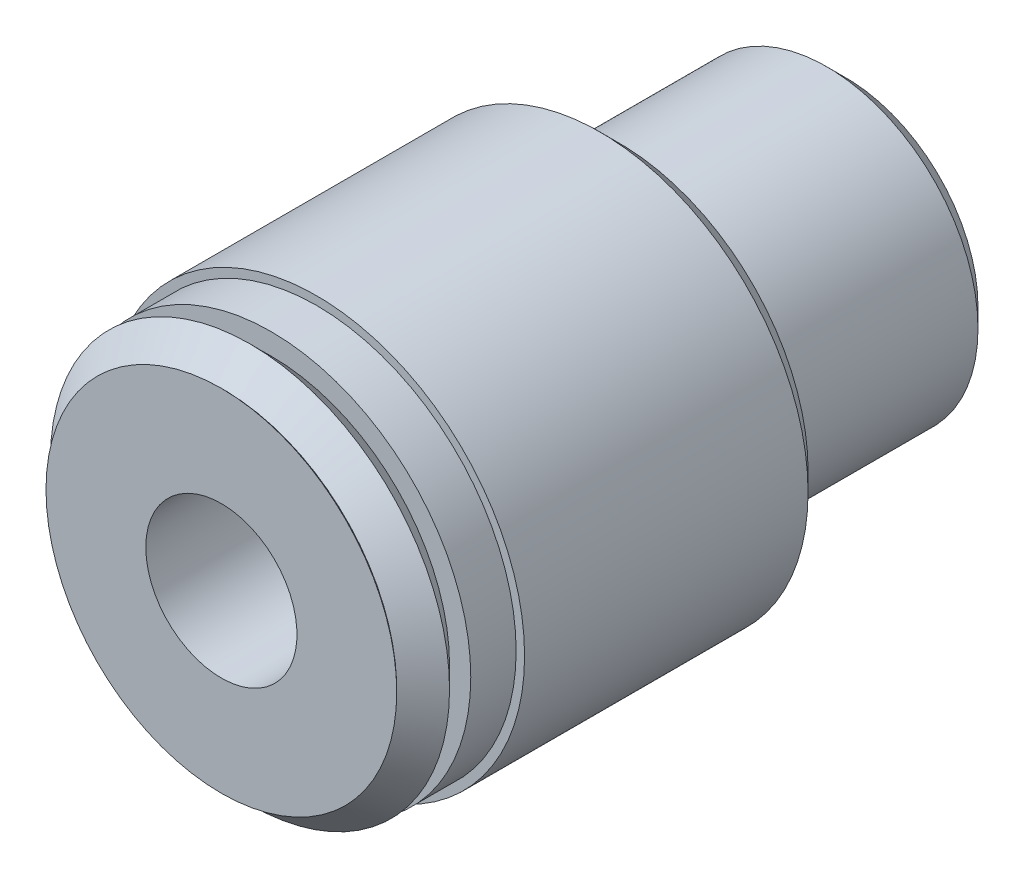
ISO-10303-21;
HEADER;
FILE_DESCRIPTION(('STEP AP214'),'2;1');
FILE_NAME('part.step','',(''),(''),'','','');
FILE_SCHEMA(('AUTOMOTIVE_DESIGN { 1 0 10303 214 1 1 1 1 }'));
ENDSEC;
DATA;
#1=APPLICATION_CONTEXT('core data for automotive mechanical design processes');
#2=APPLICATION_PROTOCOL_DEFINITION('international standard','automotive_design',2000,#1);
#3=PRODUCT_CONTEXT('',#1,'mechanical');
#4=PRODUCT('Part','Part','',(#3));
#5=PRODUCT_RELATED_PRODUCT_CATEGORY('part','',(#4));
#6=PRODUCT_DEFINITION_FORMATION('','',#4);
#7=PRODUCT_DEFINITION_CONTEXT('part definition',#1,'design');
#8=PRODUCT_DEFINITION('design','',#6,#7);
#9=PRODUCT_DEFINITION_SHAPE('','',#8);
#10=(LENGTH_UNIT() NAMED_UNIT(*) SI_UNIT(.MILLI.,.METRE.));
#11=(NAMED_UNIT(*) PLANE_ANGLE_UNIT() SI_UNIT($,.RADIAN.));
#12=(NAMED_UNIT(*) SI_UNIT($,.STERADIAN.) SOLID_ANGLE_UNIT());
#13=UNCERTAINTY_MEASURE_WITH_UNIT(LENGTH_MEASURE(1.E-05),#10,'distance_accuracy_value','');
#14=(GEOMETRIC_REPRESENTATION_CONTEXT(3) GLOBAL_UNCERTAINTY_ASSIGNED_CONTEXT((#13)) GLOBAL_UNIT_ASSIGNED_CONTEXT((#10,
#11,#12)) REPRESENTATION_CONTEXT('',''));
#15=CARTESIAN_POINT('',(0.,0.,0.));
#16=DIRECTION('',(0.,0.,1.));
#17=DIRECTION('',(1.,0.,0.));
#18=AXIS2_PLACEMENT_3D('',#15,#16,#17);
#19=CARTESIAN_POINT('',(0.,0.,0.));
#20=DIRECTION('',(0.,0.,1.));
#21=DIRECTION('',(1.,0.,0.));
#22=AXIS2_PLACEMENT_3D('',#19,#20,#21);
#23=PLANE('',#22);
#24=CARTESIAN_POINT('',(0.,0.,0.));
#25=DIRECTION('',(0.,0.,-1.));
#26=DIRECTION('',(-1.,0.,0.));
#27=AXIS2_PLACEMENT_3D('',#24,#25,#26);
#28=CIRCLE('',#27,7.366);
#29=CARTESIAN_POINT('',(-7.366,0.,0.));
#30=VERTEX_POINT('',#29);
#31=EDGE_CURVE('E115',#30,#30,#28,.T.);
#32=ORIENTED_EDGE('',*,*,#31,.F.);
#33=EDGE_LOOP('',(#32));
#34=FACE_BOUND('',#33,.T.);
#35=CARTESIAN_POINT('',(0.,0.,0.));
#36=DIRECTION('',(0.,0.,-1.));
#37=DIRECTION('',(-1.,0.,0.));
#38=AXIS2_PLACEMENT_3D('',#35,#36,#37);
#39=CIRCLE('',#38,3.175);
#40=CARTESIAN_POINT('',(-3.175,0.,0.));
#41=VERTEX_POINT('',#40);
#42=EDGE_CURVE('E126',#41,#41,#39,.T.);
#43=ORIENTED_EDGE('',*,*,#42,.T.);
#44=EDGE_LOOP('',(#43));
#45=FACE_BOUND('',#44,.T.);
#46=ADVANCED_FACE('F30',(#34,#45),#23,.T.);
#47=CARTESIAN_POINT('',(0.,0.,-26.223214));
#48=DIRECTION('',(0.,0.,-1.));
#49=DIRECTION('',(-1.,0.,0.));
#50=AXIS2_PLACEMENT_3D('',#47,#48,#49);
#51=PLANE('',#50);
#52=CARTESIAN_POINT('',(0.,0.,-26.223214));
#53=DIRECTION('',(0.,0.,-1.));
#54=DIRECTION('',(-1.,0.,0.));
#55=AXIS2_PLACEMENT_3D('',#52,#53,#54);
#56=CIRCLE('',#55,5.55625);
#57=CARTESIAN_POINT('',(5.55625,0.,-26.223214));
#58=VERTEX_POINT('',#57);
#59=EDGE_CURVE('E47',#58,#58,#56,.T.);
#60=ORIENTED_EDGE('',*,*,#59,.T.);
#61=EDGE_LOOP('',(#60));
#62=FACE_BOUND('',#61,.T.);
#63=CARTESIAN_POINT('',(0.,0.,-26.223214));
#64=DIRECTION('',(0.,0.,-1.));
#65=DIRECTION('',(-1.,0.,0.));
#66=AXIS2_PLACEMENT_3D('',#63,#64,#65);
#67=CIRCLE('',#66,3.175);
#68=CARTESIAN_POINT('',(-3.175,0.,-26.223214));
#69=VERTEX_POINT('',#68);
#70=EDGE_CURVE('E124',#69,#69,#67,.T.);
#71=ORIENTED_EDGE('',*,*,#70,.F.);
#72=EDGE_LOOP('',(#71));
#73=FACE_BOUND('',#72,.T.);
#74=ADVANCED_FACE('F63',(#62,#73),#51,.T.);
#75=CARTESIAN_POINT('',(-8.7376,0.,-7.173214));
#76=DIRECTION('',(1.,0.,0.));
#77=DIRECTION('',(0.,0.,-1.));
#78=AXIS2_PLACEMENT_3D('',#75,#76,#77);
#79=CYLINDRICAL_SURFACE('',#78,2.032);
#80=CARTESIAN_POINT('',(-8.7376,0.,-9.205214));
#81=CARTESIAN_POINT('',(-8.73759797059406,-0.11251614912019,-9.20521042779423));
#82=CARTESIAN_POINT('',(-8.7354047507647,-0.225074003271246,-9.1958371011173));
#83=CARTESIAN_POINT('',(-8.72686767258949,-0.446980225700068,-9.15863769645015));
#84=CARTESIAN_POINT('',(-8.72052111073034,-0.556326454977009,-9.13079959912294));
#85=CARTESIAN_POINT('',(-8.70438234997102,-0.768571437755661,-9.05759945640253));
#86=CARTESIAN_POINT('',(-8.6945939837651,-0.871477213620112,-9.0122568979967));
#87=CARTESIAN_POINT('',(-8.67262205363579,-1.06821919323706,-8.90539972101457));
#88=CARTESIAN_POINT('',(-8.66043848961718,-1.16205539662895,-8.84388510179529));
#89=CARTESIAN_POINT('',(-8.63476052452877,-1.33968569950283,-8.7052590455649));
#90=CARTESIAN_POINT('',(-8.62124813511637,-1.42329320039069,-8.62791182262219));
#91=CARTESIAN_POINT('',(-8.59455904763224,-1.57647313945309,-8.46032176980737));
#92=CARTESIAN_POINT('',(-8.58138238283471,-1.64604419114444,-8.37007766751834));
#93=CARTESIAN_POINT('',(-8.55667768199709,-1.7700227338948,-8.17784635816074));
#94=CARTESIAN_POINT('',(-8.54517260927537,-1.82422727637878,-8.07572504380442));
#95=CARTESIAN_POINT('',(-8.52537378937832,-1.91463093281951,-7.86351031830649));
#96=CARTESIAN_POINT('',(-8.51707960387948,-1.9508325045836,-7.75341799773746));
#97=CARTESIAN_POINT('',(-8.50482562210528,-2.00357737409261,-7.53042272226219));
#98=CARTESIAN_POINT('',(-8.50079258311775,-2.02045329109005,-7.4176025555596));
#99=CARTESIAN_POINT('',(-8.4972978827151,-2.03510284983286,-7.19066583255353));
#100=CARTESIAN_POINT('',(-8.49783558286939,-2.03287915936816,-7.07654945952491));
#101=CARTESIAN_POINT('',(-8.50335549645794,-2.00965931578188,-6.85276454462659));
#102=CARTESIAN_POINT('',(-8.50824523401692,-1.9890537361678,-6.74305284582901));
#103=CARTESIAN_POINT('',(-8.52177157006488,-1.93027563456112,-6.52868762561));
#104=CARTESIAN_POINT('',(-8.53040840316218,-1.89210201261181,-6.42403442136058));
#105=CARTESIAN_POINT('',(-8.55054421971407,-1.79892392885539,-6.22168063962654));
#106=CARTESIAN_POINT('',(-8.56206795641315,-1.7437729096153,-6.12405011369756));
#107=CARTESIAN_POINT('',(-8.5866644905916,-1.61830836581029,-5.93928667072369));
#108=CARTESIAN_POINT('',(-8.59973752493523,-1.54799252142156,-5.85215536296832));
#109=CARTESIAN_POINT('',(-8.62635329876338,-1.39214573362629,-5.68861933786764));
#110=CARTESIAN_POINT('',(-8.63989969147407,-1.30628371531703,-5.61253037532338));
#111=CARTESIAN_POINT('',(-8.66564488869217,-1.12286054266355,-5.47577636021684));
#112=CARTESIAN_POINT('',(-8.67784366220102,-1.02529911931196,-5.41511166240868));
#113=CARTESIAN_POINT('',(-8.69956723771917,-0.820833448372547,-5.3108342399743));
#114=CARTESIAN_POINT('',(-8.70908487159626,-0.713905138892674,-5.26726710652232));
#115=CARTESIAN_POINT('',(-8.72432110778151,-0.493973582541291,-5.19880975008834));
#116=CARTESIAN_POINT('',(-8.73004033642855,-0.380971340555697,-5.17391644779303));
#117=CARTESIAN_POINT('',(-8.73694469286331,-0.15480428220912,-5.14398241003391));
#118=CARTESIAN_POINT('',(-8.73822817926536,-0.0416993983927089,-5.13851093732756));
#119=CARTESIAN_POINT('',(-8.73639399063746,0.183808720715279,-5.14640245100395));
#120=CARTESIAN_POINT('',(-8.73327665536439,0.296212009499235,-5.15976398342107));
#121=CARTESIAN_POINT('',(-8.72305358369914,0.515669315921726,-5.20458583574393));
#122=CARTESIAN_POINT('',(-8.71599851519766,0.622772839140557,-5.23581635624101));
#123=CARTESIAN_POINT('',(-8.69869154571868,0.830218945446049,-5.31523144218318));
#124=CARTESIAN_POINT('',(-8.68843934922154,0.930560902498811,-5.36341757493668));
#125=CARTESIAN_POINT('',(-8.66563542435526,1.123388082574,-5.47624658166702));
#126=CARTESIAN_POINT('',(-8.65304991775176,1.21572409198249,-5.54113748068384));
#127=CARTESIAN_POINT('',(-8.62703722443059,1.3883502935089,-5.68521157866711));
#128=CARTESIAN_POINT('',(-8.61360991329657,1.46863869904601,-5.76439689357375));
#129=CARTESIAN_POINT('',(-8.58708097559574,1.61662481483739,-5.93679944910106));
#130=CARTESIAN_POINT('',(-8.57399212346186,1.68402246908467,-6.03027660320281));
#131=CARTESIAN_POINT('',(-8.54994125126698,1.8021675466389,-6.22747354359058));
#132=CARTESIAN_POINT('',(-8.53897913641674,1.85291571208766,-6.33119287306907));
#133=CARTESIAN_POINT('',(-8.52053551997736,1.93595940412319,-6.54536375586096));
#134=CARTESIAN_POINT('',(-8.51303376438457,1.96836256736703,-6.6557717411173));
#135=CARTESIAN_POINT('',(-8.5023300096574,2.01410032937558,-6.88066534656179));
#136=CARTESIAN_POINT('',(-8.49912721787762,2.02743844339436,-6.99515021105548));
#137=CARTESIAN_POINT('',(-8.49743852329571,2.03450298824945,-7.22191105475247));
#138=CARTESIAN_POINT('',(-8.49883782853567,2.02870668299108,-7.33417156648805));
#139=CARTESIAN_POINT('',(-8.50593357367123,1.99874469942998,-7.55606831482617));
#140=CARTESIAN_POINT('',(-8.51162994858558,1.97457929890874,-7.66570459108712));
#141=CARTESIAN_POINT('',(-8.52661852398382,1.90880893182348,-7.87880189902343));
#142=CARTESIAN_POINT('',(-8.53589461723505,1.86728201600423,-7.98228822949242));
#143=CARTESIAN_POINT('',(-8.55700187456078,1.76803152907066,-8.18089276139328));
#144=CARTESIAN_POINT('',(-8.56883334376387,1.71030602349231,-8.27600996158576));
#145=CARTESIAN_POINT('',(-8.59405451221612,1.5787511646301,-8.45750939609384));
#146=CARTESIAN_POINT('',(-8.60747352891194,1.50458544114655,-8.54364379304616));
#147=CARTESIAN_POINT('',(-8.63417061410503,1.3429261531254,-8.70240034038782));
#148=CARTESIAN_POINT('',(-8.64744864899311,1.2554294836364,-8.77501933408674));
#149=CARTESIAN_POINT('',(-8.67260607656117,1.06799924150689,-8.90574186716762));
#150=CARTESIAN_POINT('',(-8.68446134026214,0.967897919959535,-8.96360983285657));
#151=CARTESIAN_POINT('',(-8.70519060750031,0.759128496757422,-9.06160543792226));
#152=CARTESIAN_POINT('',(-8.71406695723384,0.65046722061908,-9.1017470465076));
#153=CARTESIAN_POINT('',(-8.72636889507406,0.451515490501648,-9.15650029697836));
#154=CARTESIAN_POINT('',(-8.73055328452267,0.362250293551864,-9.17473116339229));
#155=CARTESIAN_POINT('',(-8.73616958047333,0.18199909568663,-9.19908911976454));
#156=CARTESIAN_POINT('',(-8.73760164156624,0.0910131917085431,-9.20521688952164));
#157=CARTESIAN_POINT('',(-8.7376,0.,-9.205214));
#158=B_SPLINE_CURVE_WITH_KNOTS('',3,(#80,#81,#82,#83,#84,#85,#86,#87,#88,#89,#90,#91,#92,#93,
#94,#95,#96,#97,#98,#99,#100,#101,#102,#103,#104,#105,#106,#107,#108,#109,#110,#111,#112,#113,
#114,#115,#116,#117,#118,#119,#120,#121,#122,#123,#124,#125,#126,#127,#128,#129,#130,#131,#132,
#133,#134,#135,#136,#137,#138,#139,#140,#141,#142,#143,#144,#145,#146,#147,#148,#149,#150,#151,
#152,#153,#154,#155,#156,#157),.UNSPECIFIED.,.T.,.F.,(4,2,2,2,2,2,2,2,2,2,2,2,2,2,2,2,2,2,2,2,2,
2,2,2,2,2,2,2,2,2,2,2,2,2,2,2,2,2,4),(0.,0.337215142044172,0.674650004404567,1.01171029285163,
1.34877059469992,1.69127297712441,2.0338091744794,2.38067838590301,2.72750022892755,
3.06825860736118,3.40896939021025,3.74260884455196,4.07626919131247,4.41289470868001,
4.74957175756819,5.0945120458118,5.4394602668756,5.78532215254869,6.13112699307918,
6.46921292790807,6.807272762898,7.14107976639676,7.47491763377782,7.81403098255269,
8.15319457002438,8.49948578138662,8.8457615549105,9.18998397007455,9.53414290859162,
9.86978309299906,10.2054182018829,10.5395603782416,10.8737424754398,11.2155243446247,
11.5573859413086,11.9044062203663,12.2511525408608,12.5239378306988,12.7967077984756),.UNSPECIFIED.);
#159=CARTESIAN_POINT('',(-8.7376,0.,-9.205214));
#160=VERTEX_POINT('',#159);
#161=EDGE_CURVE('E10',#160,#160,#158,.T.);
#162=ORIENTED_EDGE('',*,*,#161,.T.);
#163=EDGE_LOOP('',(#162));
#164=FACE_BOUND('',#163,.T.);
#165=CARTESIAN_POINT('',(-3.175,0.,-9.205214));
#166=CARTESIAN_POINT('',(-3.17499204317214,-0.102802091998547,-9.20520536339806));
#167=CARTESIAN_POINT('',(-3.16995556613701,-0.205712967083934,-9.19735978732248));
#168=CARTESIAN_POINT('',(-3.15028428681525,-0.408345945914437,-9.16640909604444));
#169=CARTESIAN_POINT('',(-3.13563350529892,-0.508062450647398,-9.14327857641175));
#170=CARTESIAN_POINT('',(-3.09820061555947,-0.700991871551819,-9.08313445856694));
#171=CARTESIAN_POINT('',(-3.07545897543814,-0.794234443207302,-9.04618990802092));
#172=CARTESIAN_POINT('',(-3.02371392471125,-0.972850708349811,-8.95995202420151));
#173=CARTESIAN_POINT('',(-2.99471088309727,-1.0582248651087,-8.91065941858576));
#174=CARTESIAN_POINT('',(-2.93000295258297,-1.22657617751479,-8.79669771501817));
#175=CARTESIAN_POINT('',(-2.89394397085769,-1.30878643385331,-8.7311008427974));
#176=CARTESIAN_POINT('',(-2.81976531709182,-1.46177780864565,-8.58855264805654));
#177=CARTESIAN_POINT('',(-2.7816428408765,-1.53254282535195,-8.51158561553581));
#178=CARTESIAN_POINT('',(-2.70106343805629,-1.6709775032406,-8.33559847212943));
#179=CARTESIAN_POINT('',(-2.65876858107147,-1.73674918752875,-8.23499866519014));
#180=CARTESIAN_POINT('',(-2.58104184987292,-1.8502950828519,-8.02171977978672));
#181=CARTESIAN_POINT('',(-2.5455982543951,-1.89810016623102,-7.90906185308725));
#182=CARTESIAN_POINT('',(-2.49563815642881,-1.96306433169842,-7.70567829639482));
#183=CARTESIAN_POINT('',(-2.47805527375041,-1.9850125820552,-7.61724160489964));
#184=CARTESIAN_POINT('',(-2.45219187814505,-2.01688234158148,-7.4369526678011));
#185=CARTESIAN_POINT('',(-2.4438972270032,-2.02682213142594,-7.34510583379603));
#186=CARTESIAN_POINT('',(-2.43787169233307,-2.03406844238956,-7.16026810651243));
#187=CARTESIAN_POINT('',(-2.44017346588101,-2.03133590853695,-7.06727455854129));
#188=CARTESIAN_POINT('',(-2.45503753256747,-2.01334074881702,-6.8833166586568));
#189=CARTESIAN_POINT('',(-2.46760829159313,-1.99806778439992,-6.79235404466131));
#190=CARTESIAN_POINT('',(-2.50064563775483,-1.95654400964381,-6.61751211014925));
#191=CARTESIAN_POINT('',(-2.52086589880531,-1.9306337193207,-6.53350251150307));
#192=CARTESIAN_POINT('',(-2.56695150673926,-1.86892073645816,-6.37088459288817));
#193=CARTESIAN_POINT('',(-2.59281872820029,-1.83311475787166,-6.29227807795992));
#194=CARTESIAN_POINT('',(-2.65331736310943,-1.74468379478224,-6.12652736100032));
#195=CARTESIAN_POINT('',(-2.68867632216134,-1.69014547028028,-6.04067077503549));
#196=CARTESIAN_POINT('',(-2.76097453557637,-1.56927250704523,-5.87835316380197));
#197=CARTESIAN_POINT('',(-2.79791562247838,-1.50292389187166,-5.80190345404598));
#198=CARTESIAN_POINT('',(-2.87709972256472,-1.34609593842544,-5.64633172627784));
#199=CARTESIAN_POINT('',(-2.91908129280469,-1.25342255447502,-5.56926417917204));
#200=CARTESIAN_POINT('',(-2.99680453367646,-1.05412916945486,-5.43182360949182));
#201=CARTESIAN_POINT('',(-3.03255285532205,-0.94752424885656,-5.37143275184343));
#202=CARTESIAN_POINT('',(-3.08776548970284,-0.745027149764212,-5.28013920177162));
#203=CARTESIAN_POINT('',(-3.1090528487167,-0.651197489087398,-5.24576465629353));
#204=CARTESIAN_POINT('',(-3.14330309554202,-0.458101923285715,-5.19098933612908));
#205=CARTESIAN_POINT('',(-3.15627267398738,-0.358840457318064,-5.17057732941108));
#206=CARTESIAN_POINT('',(-3.17272053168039,-0.157245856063,-5.14475268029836));
#207=CARTESIAN_POINT('',(-3.1761669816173,-0.054903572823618,-5.13939033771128));
#208=CARTESIAN_POINT('',(-3.17313166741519,0.149278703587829,-5.14413361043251));
#209=CARTESIAN_POINT('',(-3.16664932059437,0.251118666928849,-5.15424013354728));
#210=CARTESIAN_POINT('',(-3.14499563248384,0.445777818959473,-5.18838229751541));
#211=CARTESIAN_POINT('',(-3.13030442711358,0.538788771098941,-5.21164904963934));
#212=CARTESIAN_POINT('',(-3.09380938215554,0.719347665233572,-5.27043053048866));
#213=CARTESIAN_POINT('',(-3.07200434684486,0.80689468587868,-5.3059473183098));
#214=CARTESIAN_POINT('',(-3.02103940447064,0.981221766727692,-5.39098970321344));
#215=CARTESIAN_POINT('',(-2.99145375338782,1.06746270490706,-5.44135934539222));
#216=CARTESIAN_POINT('',(-2.92809272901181,1.23068208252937,-5.55325920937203));
#217=CARTESIAN_POINT('',(-2.89431411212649,1.3076532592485,-5.6147980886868));
#218=CARTESIAN_POINT('',(-2.81960831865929,1.46249777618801,-5.75798156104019));
#219=CARTESIAN_POINT('',(-2.77837700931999,1.53871535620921,-5.84126130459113));
#220=CARTESIAN_POINT('',(-2.69736409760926,1.67667876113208,-6.01974184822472));
#221=CARTESIAN_POINT('',(-2.65758278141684,1.73842174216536,-6.11494498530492));
#222=CARTESIAN_POINT('',(-2.58908117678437,1.83860127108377,-6.30242967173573));
#223=CARTESIAN_POINT('',(-2.55959229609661,1.87906802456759,-6.3933387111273));
#224=CARTESIAN_POINT('',(-2.50855535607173,1.94668410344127,-6.58206167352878));
#225=CARTESIAN_POINT('',(-2.48699628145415,1.9738519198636,-6.67986579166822));
#226=CARTESIAN_POINT('',(-2.45497691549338,2.01355343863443,-6.88126291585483));
#227=CARTESIAN_POINT('',(-2.44462296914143,2.02594703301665,-6.98490173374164));
#228=CARTESIAN_POINT('',(-2.43745721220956,2.03456932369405,-7.19329147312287));
#229=CARTESIAN_POINT('',(-2.44063557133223,2.0308097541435,-7.29804153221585));
#230=CARTESIAN_POINT('',(-2.45842888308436,2.00920052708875,-7.48955089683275));
#231=CARTESIAN_POINT('',(-2.47133063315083,1.99345832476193,-7.57672835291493));
#232=CARTESIAN_POINT('',(-2.50475552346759,1.95129345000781,-7.74695573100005));
#233=CARTESIAN_POINT('',(-2.52528621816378,1.92486018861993,-7.83000146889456));
#234=CARTESIAN_POINT('',(-2.5797835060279,1.85150505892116,-8.01844149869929));
#235=CARTESIAN_POINT('',(-2.61594204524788,1.80066154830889,-8.12167247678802));
#236=CARTESIAN_POINT('',(-2.69289797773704,1.68340470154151,-8.31697407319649));
#237=CARTESIAN_POINT('',(-2.73370159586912,1.61697034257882,-8.40902936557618));
#238=CARTESIAN_POINT('',(-2.81602892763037,1.46896419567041,-8.58184666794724));
#239=CARTESIAN_POINT('',(-2.85755546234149,1.3872233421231,-8.66246290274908));
#240=CARTESIAN_POINT('',(-2.93688941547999,1.2102578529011,-8.80953503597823));
#241=CARTESIAN_POINT('',(-2.9746967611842,1.11503295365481,-8.87599065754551));
#242=CARTESIAN_POINT('',(-3.04402026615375,0.909208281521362,-8.9944341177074));
#243=CARTESIAN_POINT('',(-3.07529902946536,0.798216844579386,-9.04589660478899));
#244=CARTESIAN_POINT('',(-3.11350948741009,0.624671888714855,-9.10779203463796));
#245=CARTESIAN_POINT('',(-3.12478960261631,0.565696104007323,-9.12586596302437));
#246=CARTESIAN_POINT('',(-3.14412176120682,0.445862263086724,-9.15665726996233));
#247=CARTESIAN_POINT('',(-3.1521760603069,0.385005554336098,-9.16937839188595));
#248=CARTESIAN_POINT('',(-3.16393226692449,0.270237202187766,-9.18788762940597));
#249=CARTESIAN_POINT('',(-3.16807141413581,0.216481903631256,-9.1943741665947));
#250=CARTESIAN_POINT('',(-3.17360741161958,0.108494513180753,-9.20303967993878));
#251=CARTESIAN_POINT('',(-3.17500419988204,0.054262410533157,-9.20521855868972));
#252=CARTESIAN_POINT('',(-3.175,0.,-9.205214));
#253=B_SPLINE_CURVE_WITH_KNOTS('',3,(#165,#166,#167,#168,#169,#170,#171,#172,#173,#174,#175,
#176,#177,#178,#179,#180,#181,#182,#183,#184,#185,#186,#187,#188,#189,#190,#191,#192,#193,#194,
#195,#196,#197,#198,#199,#200,#201,#202,#203,#204,#205,#206,#207,#208,#209,#210,#211,#212,#213,
#214,#215,#216,#217,#218,#219,#220,#221,#222,#223,#224,#225,#226,#227,#228,#229,#230,#231,#232,
#233,#234,#235,#236,#237,#238,#239,#240,#241,#242,#243,#244,#245,#246,#247,#248,#249,#250,#251,
#252),.UNSPECIFIED.,.T.,.F.,(4,2,2,2,2,2,2,2,2,2,2,2,2,2,2,2,2,2,2,2,2,2,2,2,2,2,2,2,2,2,2,2,2,
2,2,2,2,2,2,2,2,2,2,4),(0.,0.308188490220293,0.616890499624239,0.924069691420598,
1.23123078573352,1.56350950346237,1.89625169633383,2.27669378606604,2.6564791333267,
2.93374298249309,3.21058421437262,3.48827921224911,3.76620337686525,4.03584967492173,
4.30558562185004,4.62747173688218,4.94974133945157,5.33077293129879,5.71139543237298,
6.01660273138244,6.32156421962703,6.62754375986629,6.93354125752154,7.22327486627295,
7.51305719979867,7.82434582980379,8.13587678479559,8.49496144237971,8.85411659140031,
9.16428665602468,9.47402422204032,9.78667632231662,10.0991013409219,10.3665263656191,
10.6342169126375,10.9941767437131,11.3546247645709,11.7193179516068,12.0840182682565,
12.4602784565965,12.6481152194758,12.8358204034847,12.9984890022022,13.161161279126),.UNSPECIFIED.);
#254=CARTESIAN_POINT('',(-3.175,0.,-9.205214));
#255=VERTEX_POINT('',#254);
#256=EDGE_CURVE('E34',#255,#255,#253,.T.);
#257=ORIENTED_EDGE('',*,*,#256,.F.);
#258=EDGE_LOOP('',(#257));
#259=FACE_BOUND('',#258,.T.);
#260=ADVANCED_FACE('F58',(#164,#259),#79,.F.);
#261=CARTESIAN_POINT('',(0.,0.,-16.698214));
#262=DIRECTION('',(0.,0.,1.));
#263=DIRECTION('',(1.,0.,0.));
#264=AXIS2_PLACEMENT_3D('',#261,#262,#263);
#265=PLANE('',#264);
#266=CARTESIAN_POINT('',(0.,0.,-16.698214));
#267=DIRECTION('',(0.,0.,1.));
#268=DIRECTION('',(1.,0.,0.));
#269=AXIS2_PLACEMENT_3D('',#266,#267,#268);
#270=CIRCLE('',#269,7.94385);
#271=CARTESIAN_POINT('',(7.94385,0.,-16.698214));
#272=VERTEX_POINT('',#271);
#273=EDGE_CURVE('E106',#272,#272,#270,.F.);
#274=ORIENTED_EDGE('',*,*,#273,.T.);
#275=EDGE_LOOP('',(#274));
#276=FACE_BOUND('',#275,.T.);
#277=CARTESIAN_POINT('',(0.,0.,-16.698214));
#278=DIRECTION('',(0.,0.,1.));
#279=DIRECTION('',(1.,0.,0.));
#280=AXIS2_PLACEMENT_3D('',#277,#278,#279);
#281=CIRCLE('',#280,6.35);
#282=CARTESIAN_POINT('',(6.35,0.,-16.698214));
#283=VERTEX_POINT('',#282);
#284=EDGE_CURVE('E111',#283,#283,#281,.F.);
#285=ORIENTED_EDGE('',*,*,#284,.F.);
#286=EDGE_LOOP('',(#285));
#287=FACE_BOUND('',#286,.T.);
#288=ADVANCED_FACE('F62',(#276,#287),#265,.F.);
#289=CARTESIAN_POINT('',(0.,0.,-0.0927099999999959));
#290=DIRECTION('',(0.,0.,1.));
#291=DIRECTION('',(1.,0.,0.));
#292=AXIS2_PLACEMENT_3D('',#289,#290,#291);
#293=CONICAL_SURFACE('',#292,7.27329,0.785398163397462);
#294=ORIENTED_EDGE('',*,*,#31,.T.);
#295=EDGE_LOOP('',(#294));
#296=FACE_BOUND('',#295,.T.);
#297=CARTESIAN_POINT('',(0.,0.,-0.0927099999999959));
#298=DIRECTION('',(0.,0.,-1.));
#299=DIRECTION('',(-1.,0.,0.));
#300=AXIS2_PLACEMENT_3D('',#297,#298,#299);
#301=CIRCLE('',#300,7.27329);
#302=CARTESIAN_POINT('',(-7.27329,0.,-0.0927099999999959));
#303=VERTEX_POINT('',#302);
#304=EDGE_CURVE('E146',#303,#303,#301,.T.);
#305=ORIENTED_EDGE('',*,*,#304,.F.);
#306=EDGE_LOOP('',(#305));
#307=FACE_BOUND('',#306,.T.);
#308=ADVANCED_FACE('F77',(#296,#307),#293,.T.);
#309=CARTESIAN_POINT('',(0.,0.,-1.20141999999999));
#310=DIRECTION('',(0.,0.,-1.));
#311=DIRECTION('',(-1.,0.,0.));
#312=AXIS2_PLACEMENT_3D('',#309,#310,#311);
#313=CONICAL_SURFACE('',#312,8.38199999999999,0.785398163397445);
#314=ORIENTED_EDGE('',*,*,#304,.T.);
#315=EDGE_LOOP('',(#314));
#316=FACE_BOUND('',#315,.T.);
#317=CARTESIAN_POINT('',(0.,0.,-1.20141999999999));
#318=DIRECTION('',(0.,0.,-1.));
#319=DIRECTION('',(-1.,0.,0.));
#320=AXIS2_PLACEMENT_3D('',#317,#318,#319);
#321=CIRCLE('',#320,8.38199999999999);
#322=CARTESIAN_POINT('',(-8.38199999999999,0.,-1.20141999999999));
#323=VERTEX_POINT('',#322);
#324=EDGE_CURVE('E143',#323,#323,#321,.T.);
#325=ORIENTED_EDGE('',*,*,#324,.F.);
#326=EDGE_LOOP('',(#325));
#327=FACE_BOUND('',#326,.T.);
#328=ADVANCED_FACE('F152',(#316,#327),#313,.T.);
#329=CARTESIAN_POINT('',(0.,0.,-2.093214));
#330=DIRECTION('',(0.,0.,1.));
#331=DIRECTION('',(1.,0.,0.));
#332=AXIS2_PLACEMENT_3D('',#329,#330,#331);
#333=CONICAL_SURFACE('',#332,7.49020599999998,0.785398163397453);
#334=ORIENTED_EDGE('',*,*,#324,.T.);
#335=EDGE_LOOP('',(#334));
#336=FACE_BOUND('',#335,.T.);
#337=CARTESIAN_POINT('',(0.,0.,-2.093214));
#338=DIRECTION('',(0.,0.,-1.));
#339=DIRECTION('',(-1.,0.,0.));
#340=AXIS2_PLACEMENT_3D('',#337,#338,#339);
#341=CIRCLE('',#340,7.49020599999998);
#342=CARTESIAN_POINT('',(-7.49020599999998,0.,-2.093214));
#343=VERTEX_POINT('',#342);
#344=EDGE_CURVE('E140',#343,#343,#341,.T.);
#345=ORIENTED_EDGE('',*,*,#344,.F.);
#346=EDGE_LOOP('',(#345));
#347=FACE_BOUND('',#346,.T.);
#348=ADVANCED_FACE('F157',(#336,#347),#333,.T.);
#349=CARTESIAN_POINT('',(0.,7.49020599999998,-2.093214));
#350=DIRECTION('',(0.,0.,1.));
#351=DIRECTION('',(1.,0.,0.));
#352=AXIS2_PLACEMENT_3D('',#349,#350,#351);
#353=PLANE('',#352);
#354=ORIENTED_EDGE('',*,*,#344,.T.);
#355=EDGE_LOOP('',(#354));
#356=FACE_BOUND('',#355,.T.);
#357=CARTESIAN_POINT('',(0.,0.,-2.093214));
#358=DIRECTION('',(0.,0.,-1.));
#359=DIRECTION('',(-1.,0.,0.));
#360=AXIS2_PLACEMENT_3D('',#357,#358,#359);
#361=CIRCLE('',#360,8.38199999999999);
#362=CARTESIAN_POINT('',(-8.38199999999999,0.,-2.093214));
#363=VERTEX_POINT('',#362);
#364=EDGE_CURVE('E137',#363,#363,#361,.T.);
#365=ORIENTED_EDGE('',*,*,#364,.F.);
#366=EDGE_LOOP('',(#365));
#367=FACE_BOUND('',#366,.T.);
#368=ADVANCED_FACE('F162',(#356,#367),#353,.T.);
#369=CARTESIAN_POINT('',(0.,0.,-71.2941240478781));
#370=DIRECTION('',(0.,0.,-1.));
#371=DIRECTION('',(-1.,0.,0.));
#372=AXIS2_PLACEMENT_3D('',#369,#370,#371);
#373=CYLINDRICAL_SURFACE('',#372,8.38199999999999);
#374=ORIENTED_EDGE('',*,*,#364,.T.);
#375=EDGE_LOOP('',(#374));
#376=FACE_BOUND('',#375,.T.);
#377=CARTESIAN_POINT('',(0.,0.,-3.998214));
#378=DIRECTION('',(0.,0.,-1.));
#379=DIRECTION('',(-1.,0.,0.));
#380=AXIS2_PLACEMENT_3D('',#377,#378,#379);
#381=CIRCLE('',#380,8.38199999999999);
#382=CARTESIAN_POINT('',(-8.38199999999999,0.,-3.998214));
#383=VERTEX_POINT('',#382);
#384=EDGE_CURVE('E135',#383,#383,#381,.T.);
#385=ORIENTED_EDGE('',*,*,#384,.F.);
#386=EDGE_LOOP('',(#385));
#387=FACE_BOUND('',#386,.T.);
#388=ADVANCED_FACE('F84',(#376,#387),#373,.T.);
#389=CARTESIAN_POINT('',(0.,0.,-16.698214));
#390=DIRECTION('',(0.,0.,1.));
#391=DIRECTION('',(1.,0.,0.));
#392=AXIS2_PLACEMENT_3D('',#389,#390,#391);
#393=CYLINDRICAL_SURFACE('',#392,8.7376);
#394=ORIENTED_EDGE('',*,*,#161,.F.);
#395=EDGE_LOOP('',(#394));
#396=FACE_BOUND('',#395,.T.);
#397=CARTESIAN_POINT('',(0.,0.,-15.904464));
#398=DIRECTION('',(0.,0.,1.));
#399=DIRECTION('',(1.,0.,0.));
#400=AXIS2_PLACEMENT_3D('',#397,#398,#399);
#401=CIRCLE('',#400,8.7376);
#402=CARTESIAN_POINT('',(8.7376,0.,-15.904464));
#403=VERTEX_POINT('',#402);
#404=EDGE_CURVE('E109',#403,#403,#401,.T.);
#405=ORIENTED_EDGE('',*,*,#404,.T.);
#406=EDGE_LOOP('',(#405));
#407=FACE_BOUND('',#406,.T.);
#408=CARTESIAN_POINT('',(0.,0.,-3.998214));
#409=DIRECTION('',(0.,0.,1.));
#410=DIRECTION('',(1.,0.,0.));
#411=AXIS2_PLACEMENT_3D('',#408,#409,#410);
#412=CIRCLE('',#411,8.7376);
#413=CARTESIAN_POINT('',(8.7376,0.,-3.998214));
#414=VERTEX_POINT('',#413);
#415=EDGE_CURVE('E129',#414,#414,#412,.T.);
#416=ORIENTED_EDGE('',*,*,#415,.F.);
#417=EDGE_LOOP('',(#416));
#418=FACE_BOUND('',#417,.T.);
#419=ADVANCED_FACE('F54',(#396,#407,#418),#393,.T.);
#420=CARTESIAN_POINT('',(0.,0.,-3.998214));
#421=DIRECTION('',(0.,0.,1.));
#422=DIRECTION('',(1.,0.,0.));
#423=AXIS2_PLACEMENT_3D('',#420,#421,#422);
#424=PLANE('',#423);
#425=ORIENTED_EDGE('',*,*,#384,.T.);
#426=EDGE_LOOP('',(#425));
#427=FACE_BOUND('',#426,.T.);
#428=ORIENTED_EDGE('',*,*,#415,.T.);
#429=EDGE_LOOP('',(#428));
#430=FACE_BOUND('',#429,.T.);
#431=ADVANCED_FACE('F74',(#427,#430),#424,.T.);
#432=CARTESIAN_POINT('',(0.,0.,-26.223214));
#433=DIRECTION('',(0.,0.,1.));
#434=DIRECTION('',(1.,0.,0.));
#435=AXIS2_PLACEMENT_3D('',#432,#433,#434);
#436=CYLINDRICAL_SURFACE('',#435,6.35);
#437=CARTESIAN_POINT('',(0.,0.,-25.429464));
#438=DIRECTION('',(0.,0.,-1.));
#439=DIRECTION('',(-1.,0.,0.));
#440=AXIS2_PLACEMENT_3D('',#437,#438,#439);
#441=CIRCLE('',#440,6.35);
#442=CARTESIAN_POINT('',(6.35,0.,-25.429464));
#443=VERTEX_POINT('',#442);
#444=EDGE_CURVE('E43',#443,#443,#441,.F.);
#445=CARTESIAN_POINT('',(6.35,0.,-25.429464));
#446=CARTESIAN_POINT('',(6.35,0.,-25.3385134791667));
#447=CARTESIAN_POINT('',(6.35,0.,-25.2475629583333));
#448=CARTESIAN_POINT('',(6.35,0.,-25.0656619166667));
#449=CARTESIAN_POINT('',(6.35,0.,-24.9747113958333));
#450=CARTESIAN_POINT('',(6.35,0.,-24.7928103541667));
#451=CARTESIAN_POINT('',(6.35,0.,-24.7018598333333));
#452=CARTESIAN_POINT('',(6.35,0.,-24.5199587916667));
#453=CARTESIAN_POINT('',(6.35,0.,-24.4290082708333));
#454=CARTESIAN_POINT('',(6.35,0.,-24.2471072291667));
#455=CARTESIAN_POINT('',(6.35,0.,-24.1561567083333));
#456=CARTESIAN_POINT('',(6.35,0.,-23.9742556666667));
#457=CARTESIAN_POINT('',(6.35,0.,-23.8833051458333));
#458=CARTESIAN_POINT('',(6.35,0.,-23.7014041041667));
#459=CARTESIAN_POINT('',(6.35,0.,-23.6104535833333));
#460=CARTESIAN_POINT('',(6.35,0.,-23.4285525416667));
#461=CARTESIAN_POINT('',(6.35,0.,-23.3376020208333));
#462=CARTESIAN_POINT('',(6.35,0.,-23.1557009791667));
#463=CARTESIAN_POINT('',(6.35,0.,-23.0647504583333));
#464=CARTESIAN_POINT('',(6.35,0.,-22.8828494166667));
#465=CARTESIAN_POINT('',(6.35,0.,-22.7918988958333));
#466=CARTESIAN_POINT('',(6.35,0.,-22.6099978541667));
#467=CARTESIAN_POINT('',(6.35,0.,-22.5190473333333));
#468=CARTESIAN_POINT('',(6.35,0.,-22.3371462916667));
#469=CARTESIAN_POINT('',(6.35,0.,-22.2461957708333));
#470=CARTESIAN_POINT('',(6.35,0.,-22.0642947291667));
#471=CARTESIAN_POINT('',(6.35,0.,-21.9733442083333));
#472=CARTESIAN_POINT('',(6.35,0.,-21.7914431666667));
#473=CARTESIAN_POINT('',(6.35,0.,-21.7004926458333));
#474=CARTESIAN_POINT('',(6.35,0.,-21.5185916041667));
#475=CARTESIAN_POINT('',(6.35,0.,-21.4276410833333));
#476=CARTESIAN_POINT('',(6.35,0.,-21.2457400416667));
#477=CARTESIAN_POINT('',(6.35,0.,-21.1547895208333));
#478=CARTESIAN_POINT('',(6.35,0.,-20.9728884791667));
#479=CARTESIAN_POINT('',(6.35,0.,-20.8819379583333));
#480=CARTESIAN_POINT('',(6.35,0.,-20.7000369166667));
#481=CARTESIAN_POINT('',(6.35,0.,-20.6090863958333));
#482=CARTESIAN_POINT('',(6.35,0.,-20.4271853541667));
#483=CARTESIAN_POINT('',(6.35,0.,-20.3362348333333));
#484=CARTESIAN_POINT('',(6.35,0.,-20.1543337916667));
#485=CARTESIAN_POINT('',(6.35,0.,-20.0633832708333));
#486=CARTESIAN_POINT('',(6.35,0.,-19.8814822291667));
#487=CARTESIAN_POINT('',(6.35,0.,-19.7905317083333));
#488=CARTESIAN_POINT('',(6.35,0.,-19.6086306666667));
#489=CARTESIAN_POINT('',(6.35,0.,-19.5176801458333));
#490=CARTESIAN_POINT('',(6.35,0.,-19.3357791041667));
#491=CARTESIAN_POINT('',(6.35,0.,-19.2448285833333));
#492=CARTESIAN_POINT('',(6.35,0.,-19.0629275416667));
#493=CARTESIAN_POINT('',(6.35,0.,-18.9719770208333));
#494=CARTESIAN_POINT('',(6.35,0.,-18.7900759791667));
#495=CARTESIAN_POINT('',(6.35,0.,-18.6991254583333));
#496=CARTESIAN_POINT('',(6.35,0.,-18.5172244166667));
#497=CARTESIAN_POINT('',(6.35,0.,-18.4262738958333));
#498=CARTESIAN_POINT('',(6.35,0.,-18.2443728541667));
#499=CARTESIAN_POINT('',(6.35,0.,-18.1534223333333));
#500=CARTESIAN_POINT('',(6.35,0.,-17.9715212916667));
#501=CARTESIAN_POINT('',(6.35,0.,-17.8805707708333));
#502=CARTESIAN_POINT('',(6.35,0.,-17.6986697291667));
#503=CARTESIAN_POINT('',(6.35,0.,-17.6077192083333));
#504=CARTESIAN_POINT('',(6.35,0.,-17.4258181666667));
#505=CARTESIAN_POINT('',(6.35,0.,-17.3348676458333));
#506=CARTESIAN_POINT('',(6.35,0.,-17.1529666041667));
#507=CARTESIAN_POINT('',(6.35,0.,-17.0620160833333));
#508=CARTESIAN_POINT('',(6.35,0.,-16.8801150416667));
#509=CARTESIAN_POINT('',(6.35,0.,-16.7891645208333));
#510=CARTESIAN_POINT('',(6.35,0.,-16.698214));
#511=B_SPLINE_CURVE_WITH_KNOTS('',3,(#445,#446,#447,#448,#449,#450,#451,#452,#453,#454,#455,
#456,#457,#458,#459,#460,#461,#462,#463,#464,#465,#466,#467,#468,#469,#470,#471,#472,#473,#474,
#475,#476,#477,#478,#479,#480,#481,#482,#483,#484,#485,#486,#487,#488,#489,#490,#491,#492,#493,
#494,#495,#496,#497,#498,#499,#500,#501,#502,#503,#504,#505,#506,#507,#508,#509,#510),
.UNSPECIFIED.,.F.,.F.,(4,2,2,2,2,2,2,2,2,2,2,2,2,2,2,2,2,2,2,2,2,2,2,2,2,2,2,2,2,2,2,2,4),(0.,
0.272851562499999,0.545703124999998,0.818554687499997,1.09140625,1.3642578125,1.637109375,
1.9099609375,2.1828125,2.4556640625,2.728515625,3.0013671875,3.27421875,3.5470703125,
3.819921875,4.0927734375,4.36562499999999,4.6384765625,4.911328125,5.1841796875,5.45703125,
5.7298828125,6.002734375,6.27558593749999,6.5484375,6.8212890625,7.094140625,7.36699218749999,
7.63984375,7.91269531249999,8.18554687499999,8.45839843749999,8.73124999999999),.UNSPECIFIED.);
#512=EDGE_CURVE('BSEAM70',#443,#283,#511,.T.);
#513=ORIENTED_EDGE('',*,*,#444,.T.);
#514=ORIENTED_EDGE('',*,*,#284,.T.);
#515=ORIENTED_EDGE('',*,*,#512,.T.);
#516=ORIENTED_EDGE('',*,*,#512,.F.);
#517=EDGE_LOOP('',(#513,#515,#514,#516));
#518=FACE_BOUND('',#517,.T.);
#519=ADVANCED_FACE('F70',(#518),#436,.T.);
#520=CARTESIAN_POINT('',(0.,0.,-15.904464));
#521=DIRECTION('',(0.,0.,1.));
#522=DIRECTION('',(1.,0.,0.));
#523=AXIS2_PLACEMENT_3D('',#520,#521,#522);
#524=CONICAL_SURFACE('',#523,8.7376,0.78539816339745);
#525=ORIENTED_EDGE('',*,*,#273,.F.);
#526=EDGE_LOOP('',(#525));
#527=FACE_BOUND('',#526,.T.);
#528=ORIENTED_EDGE('',*,*,#404,.F.);
#529=EDGE_LOOP('',(#528));
#530=FACE_BOUND('',#529,.T.);
#531=ADVANCED_FACE('F73',(#527,#530),#524,.T.);
#532=CARTESIAN_POINT('',(0.,0.,-26.223214));
#533=DIRECTION('',(0.,0.,1.));
#534=DIRECTION('',(1.,0.,0.));
#535=AXIS2_PLACEMENT_3D('',#532,#533,#534);
#536=CONICAL_SURFACE('',#535,5.55625,0.785398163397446);
#537=CARTESIAN_POINT('',(6.35,0.,-25.429464));
#538=CARTESIAN_POINT('',(6.34173177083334,0.,-25.4377322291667));
#539=CARTESIAN_POINT('',(6.33346354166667,0.,-25.4460004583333));
#540=CARTESIAN_POINT('',(6.31692708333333,0.,-25.4625369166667));
#541=CARTESIAN_POINT('',(6.30865885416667,0.,-25.4708051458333));
#542=CARTESIAN_POINT('',(6.29212239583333,0.,-25.4873416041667));
#543=CARTESIAN_POINT('',(6.28385416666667,0.,-25.4956098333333));
#544=CARTESIAN_POINT('',(6.26731770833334,0.,-25.5121462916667));
#545=CARTESIAN_POINT('',(6.25904947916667,0.,-25.5204145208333));
#546=CARTESIAN_POINT('',(6.24251302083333,0.,-25.5369509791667));
#547=CARTESIAN_POINT('',(6.23424479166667,0.,-25.5452192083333));
#548=CARTESIAN_POINT('',(6.21770833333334,0.,-25.5617556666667));
#549=CARTESIAN_POINT('',(6.20944010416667,0.,-25.5700238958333));
#550=CARTESIAN_POINT('',(6.19290364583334,0.,-25.5865603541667));
#551=CARTESIAN_POINT('',(6.18463541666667,0.,-25.5948285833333));
#552=CARTESIAN_POINT('',(6.16809895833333,0.,-25.6113650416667));
#553=CARTESIAN_POINT('',(6.15983072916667,0.,-25.6196332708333));
#554=CARTESIAN_POINT('',(6.14329427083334,0.,-25.6361697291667));
#555=CARTESIAN_POINT('',(6.13502604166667,0.,-25.6444379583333));
#556=CARTESIAN_POINT('',(6.11848958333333,0.,-25.6609744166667));
#557=CARTESIAN_POINT('',(6.11022135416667,0.,-25.6692426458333));
#558=CARTESIAN_POINT('',(6.09368489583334,0.,-25.6857791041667));
#559=CARTESIAN_POINT('',(6.08541666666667,0.,-25.6940473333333));
#560=CARTESIAN_POINT('',(6.06888020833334,0.,-25.7105837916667));
#561=CARTESIAN_POINT('',(6.06061197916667,0.,-25.7188520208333));
#562=CARTESIAN_POINT('',(6.04407552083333,0.,-25.7353884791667));
#563=CARTESIAN_POINT('',(6.03580729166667,0.,-25.7436567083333));
#564=CARTESIAN_POINT('',(6.01927083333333,0.,-25.7601931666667));
#565=CARTESIAN_POINT('',(6.01100260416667,0.,-25.7684613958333));
#566=CARTESIAN_POINT('',(5.99446614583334,0.,-25.7849978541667));
#567=CARTESIAN_POINT('',(5.98619791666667,0.,-25.7932660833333));
#568=CARTESIAN_POINT('',(5.96966145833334,0.,-25.8098025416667));
#569=CARTESIAN_POINT('',(5.96139322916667,0.,-25.8180707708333));
#570=CARTESIAN_POINT('',(5.94485677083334,0.,-25.8346072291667));
#571=CARTESIAN_POINT('',(5.93658854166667,0.,-25.8428754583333));
#572=CARTESIAN_POINT('',(5.92005208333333,0.,-25.8594119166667));
#573=CARTESIAN_POINT('',(5.91178385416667,0.,-25.8676801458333));
#574=CARTESIAN_POINT('',(5.89524739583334,0.,-25.8842166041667));
#575=CARTESIAN_POINT('',(5.88697916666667,0.,-25.8924848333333));
#576=CARTESIAN_POINT('',(5.87044270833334,0.,-25.9090212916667));
#577=CARTESIAN_POINT('',(5.86217447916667,0.,-25.9172895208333));
#578=CARTESIAN_POINT('',(5.84563802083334,0.,-25.9338259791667));
#579=CARTESIAN_POINT('',(5.83736979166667,0.,-25.9420942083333));
#580=CARTESIAN_POINT('',(5.82083333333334,0.,-25.9586306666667));
#581=CARTESIAN_POINT('',(5.81256510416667,0.,-25.9668988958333));
#582=CARTESIAN_POINT('',(5.79602864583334,0.,-25.9834353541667));
#583=CARTESIAN_POINT('',(5.78776041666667,0.,-25.9917035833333));
#584=CARTESIAN_POINT('',(5.77122395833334,0.,-26.0082400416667));
#585=CARTESIAN_POINT('',(5.76295572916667,0.,-26.0165082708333));
#586=CARTESIAN_POINT('',(5.74641927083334,0.,-26.0330447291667));
#587=CARTESIAN_POINT('',(5.73815104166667,0.,-26.0413129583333));
#588=CARTESIAN_POINT('',(5.72161458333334,0.,-26.0578494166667));
#589=CARTESIAN_POINT('',(5.71334635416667,0.,-26.0661176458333));
#590=CARTESIAN_POINT('',(5.69680989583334,0.,-26.0826541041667));
#591=CARTESIAN_POINT('',(5.68854166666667,0.,-26.0909223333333));
#592=CARTESIAN_POINT('',(5.67200520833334,0.,-26.1074587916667));
#593=CARTESIAN_POINT('',(5.66373697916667,0.,-26.1157270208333));
#594=CARTESIAN_POINT('',(5.64720052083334,0.,-26.1322634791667));
#595=CARTESIAN_POINT('',(5.63893229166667,0.,-26.1405317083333));
#596=CARTESIAN_POINT('',(5.62239583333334,0.,-26.1570681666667));
#597=CARTESIAN_POINT('',(5.61412760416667,0.,-26.1653363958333));
#598=CARTESIAN_POINT('',(5.59759114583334,0.,-26.1818728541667));
#599=CARTESIAN_POINT('',(5.58932291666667,0.,-26.1901410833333));
#600=CARTESIAN_POINT('',(5.57278645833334,0.,-26.2066775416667));
#601=CARTESIAN_POINT('',(5.56451822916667,0.,-26.2149457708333));
#602=CARTESIAN_POINT('',(5.55625,0.,-26.223214));
#603=B_SPLINE_CURVE_WITH_KNOTS('',3,(#537,#538,#539,#540,#541,#542,#543,#544,#545,#546,#547,
#548,#549,#550,#551,#552,#553,#554,#555,#556,#557,#558,#559,#560,#561,#562,#563,#564,#565,#566,
#567,#568,#569,#570,#571,#572,#573,#574,#575,#576,#577,#578,#579,#580,#581,#582,#583,#584,#585,
#586,#587,#588,#589,#590,#591,#592,#593,#594,#595,#596,#597,#598,#599,#600,#601,#602),
.UNSPECIFIED.,.F.,.F.,(4,2,2,2,2,2,2,2,2,2,2,2,2,2,2,2,2,2,2,2,2,2,2,2,2,2,2,2,2,2,2,2,4),(0.,
0.0350791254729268,0.0701582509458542,0.105237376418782,0.140316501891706,0.175395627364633,
0.21047475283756,0.245553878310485,0.280633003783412,0.315712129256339,0.350791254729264,
0.385870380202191,0.420949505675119,0.456028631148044,0.49110775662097,0.526186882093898,
0.561266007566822,0.59634513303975,0.631424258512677,0.666503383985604,0.701582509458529,
0.736661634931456,0.771740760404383,0.806819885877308,0.841899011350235,0.876978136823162,
0.912057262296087,0.947136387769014,0.982215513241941,1.01729463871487,1.05237376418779,
1.08745288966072,1.12253201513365),.UNSPECIFIED.);
#604=EDGE_CURVE('BSEAM32',#443,#58,#603,.T.);
#605=ORIENTED_EDGE('',*,*,#444,.F.);
#606=ORIENTED_EDGE('',*,*,#59,.F.);
#607=ORIENTED_EDGE('',*,*,#604,.T.);
#608=ORIENTED_EDGE('',*,*,#604,.F.);
#609=EDGE_LOOP('',(#605,#607,#606,#608));
#610=FACE_BOUND('',#609,.T.);
#611=ADVANCED_FACE('F32',(#610),#536,.T.);
#612=CARTESIAN_POINT('',(0.,0.,-26.223214));
#613=DIRECTION('',(0.,0.,1.));
#614=DIRECTION('',(1.,0.,0.));
#615=AXIS2_PLACEMENT_3D('',#612,#613,#614);
#616=CYLINDRICAL_SURFACE('',#615,3.175);
#617=ORIENTED_EDGE('',*,*,#70,.T.);
#618=EDGE_LOOP('',(#617));
#619=FACE_BOUND('',#618,.T.);
#620=ORIENTED_EDGE('',*,*,#42,.F.);
#621=EDGE_LOOP('',(#620));
#622=FACE_BOUND('',#621,.T.);
#623=ORIENTED_EDGE('',*,*,#256,.T.);
#624=EDGE_LOOP('',(#623));
#625=FACE_BOUND('',#624,.T.);
#626=ADVANCED_FACE('F64',(#619,#622,#625),#616,.F.);
#627=CLOSED_SHELL('',(#46,#74,#260,#288,#308,#328,#348,#368,#388,#419,#431,#519,#531,#611,#626));
#628=MANIFOLD_SOLID_BREP('B2',#627);
#629=ADVANCED_BREP_SHAPE_REPRESENTATION('',(#18,#628),#14);
#630=SHAPE_DEFINITION_REPRESENTATION(#9,#629);
ENDSEC;
END-ISO-10303-21;
